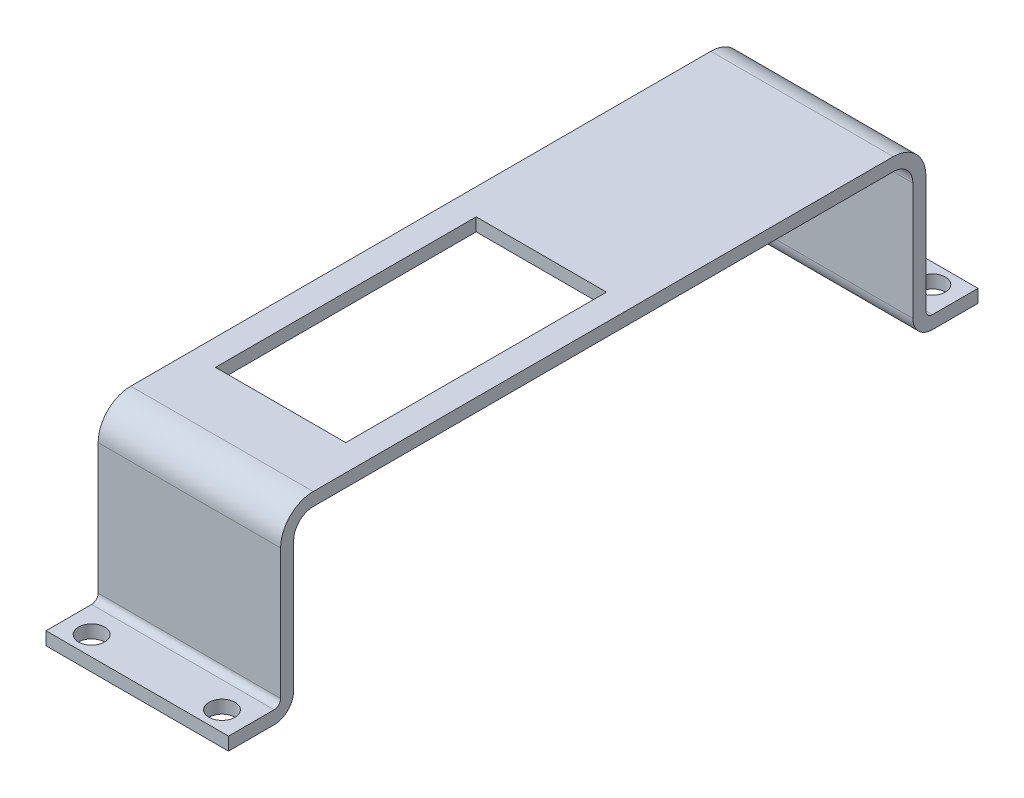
ISO-10303-21;
HEADER;
FILE_DESCRIPTION(('STEP AP214'),'2;1');
FILE_NAME('part.step','',(''),(''),'','','');
FILE_SCHEMA(('AUTOMOTIVE_DESIGN { 1 0 10303 214 1 1 1 1 }'));
ENDSEC;
DATA;
#1=APPLICATION_CONTEXT('core data for automotive mechanical design processes');
#2=APPLICATION_PROTOCOL_DEFINITION('international standard','automotive_design',2000,#1);
#3=PRODUCT_CONTEXT('',#1,'mechanical');
#4=PRODUCT('Part','Part','',(#3));
#5=PRODUCT_RELATED_PRODUCT_CATEGORY('part','',(#4));
#6=PRODUCT_DEFINITION_FORMATION('','',#4);
#7=PRODUCT_DEFINITION_CONTEXT('part definition',#1,'design');
#8=PRODUCT_DEFINITION('design','',#6,#7);
#9=PRODUCT_DEFINITION_SHAPE('','',#8);
#10=(LENGTH_UNIT() NAMED_UNIT(*) SI_UNIT(.MILLI.,.METRE.));
#11=(NAMED_UNIT(*) PLANE_ANGLE_UNIT() SI_UNIT($,.RADIAN.));
#12=(NAMED_UNIT(*) SI_UNIT($,.STERADIAN.) SOLID_ANGLE_UNIT());
#13=UNCERTAINTY_MEASURE_WITH_UNIT(LENGTH_MEASURE(1.E-05),#10,'distance_accuracy_value','');
#14=(GEOMETRIC_REPRESENTATION_CONTEXT(3) GLOBAL_UNCERTAINTY_ASSIGNED_CONTEXT((#13)) GLOBAL_UNIT_ASSIGNED_CONTEXT((#10,
#11,#12)) REPRESENTATION_CONTEXT('',''));
#15=CARTESIAN_POINT('',(0.,0.,0.));
#16=DIRECTION('',(0.,0.,1.));
#17=DIRECTION('',(1.,0.,0.));
#18=AXIS2_PLACEMENT_3D('',#15,#16,#17);
#19=CARTESIAN_POINT('',(14.,2.,-10.));
#20=DIRECTION('',(0.,0.,1.));
#21=DIRECTION('',(1.,0.,0.));
#22=AXIS2_PLACEMENT_3D('',#19,#20,#21);
#23=PLANE('',#22);
#24=DIRECTION('',(0.,1.,0.));
#25=VECTOR('',#24,1.);
#26=CARTESIAN_POINT('',(-14.,2.,-10.));
#27=LINE('',#26,#25);
#28=CARTESIAN_POINT('',(-14.,0.,-10.));
#29=VERTEX_POINT('',#28);
#30=CARTESIAN_POINT('',(-14.,2.,-10.));
#31=VERTEX_POINT('',#30);
#32=EDGE_CURVE('E221',#29,#31,#27,.T.);
#33=ORIENTED_EDGE('',*,*,#32,.T.);
#34=DIRECTION('',(-1.,0.,0.));
#35=VECTOR('',#34,1.);
#36=CARTESIAN_POINT('',(14.,2.,-10.));
#37=LINE('',#36,#35);
#38=CARTESIAN_POINT('',(14.,2.,-10.));
#39=VERTEX_POINT('',#38);
#40=EDGE_CURVE('E362',#39,#31,#37,.T.);
#41=ORIENTED_EDGE('',*,*,#40,.F.);
#42=DIRECTION('',(0.,1.,0.));
#43=VECTOR('',#42,1.);
#44=CARTESIAN_POINT('',(14.,2.,-10.));
#45=LINE('',#44,#43);
#46=CARTESIAN_POINT('',(14.,0.,-10.));
#47=VERTEX_POINT('',#46);
#48=EDGE_CURVE('E224',#47,#39,#45,.T.);
#49=ORIENTED_EDGE('',*,*,#48,.F.);
#50=DIRECTION('',(-1.,0.,0.));
#51=VECTOR('',#50,1.);
#52=CARTESIAN_POINT('',(14.,0.,-10.));
#53=LINE('',#52,#51);
#54=EDGE_CURVE('E266',#47,#29,#53,.T.);
#55=ORIENTED_EDGE('',*,*,#54,.T.);
#56=EDGE_LOOP('',(#33,#41,#49,#55));
#57=FACE_BOUND('',#56,.T.);
#58=ADVANCED_FACE('F33',(#57),#23,.F.);
#59=CARTESIAN_POINT('',(14.,2.,-3.));
#60=DIRECTION('',(0.,-1.,0.));
#61=DIRECTION('',(0.,0.,-1.));
#62=AXIS2_PLACEMENT_3D('',#59,#60,#61);
#63=PLANE('',#62);
#64=CARTESIAN_POINT('',(-10.,2.,-7.));
#65=DIRECTION('',(0.,1.,0.));
#66=DIRECTION('',(0.,0.,1.));
#67=AXIS2_PLACEMENT_3D('',#64,#65,#66);
#68=CIRCLE('',#67,2.);
#69=CARTESIAN_POINT('',(-10.,2.,-5.));
#70=VERTEX_POINT('',#69);
#71=EDGE_CURVE('E383',#70,#70,#68,.T.);
#72=ORIENTED_EDGE('',*,*,#71,.F.);
#73=EDGE_LOOP('',(#72));
#74=FACE_BOUND('',#73,.T.);
#75=CARTESIAN_POINT('',(10.,2.,-7.));
#76=DIRECTION('',(0.,1.,0.));
#77=DIRECTION('',(0.,0.,1.));
#78=AXIS2_PLACEMENT_3D('',#75,#76,#77);
#79=CIRCLE('',#78,2.);
#80=CARTESIAN_POINT('',(10.,2.,-5.));
#81=VERTEX_POINT('',#80);
#82=EDGE_CURVE('E372',#81,#81,#79,.T.);
#83=ORIENTED_EDGE('',*,*,#82,.F.);
#84=EDGE_LOOP('',(#83));
#85=FACE_BOUND('',#84,.T.);
#86=DIRECTION('',(0.,0.,1.));
#87=VECTOR('',#86,1.);
#88=CARTESIAN_POINT('',(-14.,2.,-3.));
#89=LINE('',#88,#87);
#90=CARTESIAN_POINT('',(-14.,2.,-3.));
#91=VERTEX_POINT('',#90);
#92=EDGE_CURVE('E269',#31,#91,#89,.T.);
#93=ORIENTED_EDGE('',*,*,#92,.T.);
#94=DIRECTION('',(-1.,0.,0.));
#95=VECTOR('',#94,1.);
#96=CARTESIAN_POINT('',(14.,2.,-3.));
#97=LINE('',#96,#95);
#98=CARTESIAN_POINT('',(14.,2.,-3.));
#99=VERTEX_POINT('',#98);
#100=EDGE_CURVE('E359',#99,#91,#97,.T.);
#101=ORIENTED_EDGE('',*,*,#100,.F.);
#102=DIRECTION('',(0.,0.,1.));
#103=VECTOR('',#102,1.);
#104=CARTESIAN_POINT('',(14.,2.,-3.));
#105=LINE('',#104,#103);
#106=EDGE_CURVE('E227',#39,#99,#105,.T.);
#107=ORIENTED_EDGE('',*,*,#106,.F.);
#108=ORIENTED_EDGE('',*,*,#40,.T.);
#109=EDGE_LOOP('',(#93,#101,#107,#108));
#110=FACE_BOUND('',#109,.T.);
#111=ADVANCED_FACE('F465',(#74,#85,#110),#63,.F.);
#112=CARTESIAN_POINT('',(14.,3.,-3.));
#113=DIRECTION('',(-1.,0.,0.));
#114=DIRECTION('',(0.,0.,1.));
#115=AXIS2_PLACEMENT_3D('',#112,#113,#114);
#116=CYLINDRICAL_SURFACE('',#115,1.);
#117=CARTESIAN_POINT('',(-14.,3.,-3.));
#118=DIRECTION('',(-1.,0.,0.));
#119=DIRECTION('',(0.,0.,-1.));
#120=AXIS2_PLACEMENT_3D('',#117,#118,#119);
#121=CIRCLE('',#120,1.);
#122=CARTESIAN_POINT('',(-14.,3.,-2.));
#123=VERTEX_POINT('',#122);
#124=EDGE_CURVE('E271',#91,#123,#121,.T.);
#125=ORIENTED_EDGE('',*,*,#124,.T.);
#126=DIRECTION('',(-1.,0.,0.));
#127=VECTOR('',#126,1.);
#128=CARTESIAN_POINT('',(14.,3.,-2.));
#129=LINE('',#128,#127);
#130=CARTESIAN_POINT('',(14.,3.,-2.));
#131=VERTEX_POINT('',#130);
#132=EDGE_CURVE('E356',#131,#123,#129,.T.);
#133=ORIENTED_EDGE('',*,*,#132,.F.);
#134=CARTESIAN_POINT('',(14.,3.,-3.));
#135=DIRECTION('',(-1.,0.,0.));
#136=DIRECTION('',(0.,0.,-1.));
#137=AXIS2_PLACEMENT_3D('',#134,#135,#136);
#138=CIRCLE('',#137,1.);
#139=EDGE_CURVE('E230',#99,#131,#138,.T.);
#140=ORIENTED_EDGE('',*,*,#139,.F.);
#141=ORIENTED_EDGE('',*,*,#100,.T.);
#142=EDGE_LOOP('',(#125,#133,#140,#141));
#143=FACE_BOUND('',#142,.T.);
#144=ADVANCED_FACE('F460',(#143),#116,.F.);
#145=CARTESIAN_POINT('',(14.,21.,-2.));
#146=DIRECTION('',(0.,0.,1.));
#147=DIRECTION('',(0.,-1.,0.));
#148=AXIS2_PLACEMENT_3D('',#145,#146,#147);
#149=PLANE('',#148);
#150=DIRECTION('',(0.,1.,0.));
#151=VECTOR('',#150,1.);
#152=CARTESIAN_POINT('',(-14.,21.,-2.));
#153=LINE('',#152,#151);
#154=CARTESIAN_POINT('',(-14.,21.,-2.));
#155=VERTEX_POINT('',#154);
#156=EDGE_CURVE('E273',#123,#155,#153,.T.);
#157=ORIENTED_EDGE('',*,*,#156,.T.);
#158=DIRECTION('',(-1.,0.,0.));
#159=VECTOR('',#158,1.);
#160=CARTESIAN_POINT('',(14.,21.,-2.));
#161=LINE('',#160,#159);
#162=CARTESIAN_POINT('',(14.,21.,-2.));
#163=VERTEX_POINT('',#162);
#164=EDGE_CURVE('E353',#163,#155,#161,.T.);
#165=ORIENTED_EDGE('',*,*,#164,.F.);
#166=DIRECTION('',(0.,1.,0.));
#167=VECTOR('',#166,1.);
#168=CARTESIAN_POINT('',(14.,21.,-2.));
#169=LINE('',#168,#167);
#170=EDGE_CURVE('E232',#131,#163,#169,.T.);
#171=ORIENTED_EDGE('',*,*,#170,.F.);
#172=ORIENTED_EDGE('',*,*,#132,.T.);
#173=EDGE_LOOP('',(#157,#165,#171,#172));
#174=FACE_BOUND('',#173,.T.);
#175=ADVANCED_FACE('F456',(#174),#149,.F.);
#176=CARTESIAN_POINT('',(14.,21.,3.));
#177=DIRECTION('',(-1.,0.,0.));
#178=DIRECTION('',(0.,0.,1.));
#179=AXIS2_PLACEMENT_3D('',#176,#177,#178);
#180=CYLINDRICAL_SURFACE('',#179,5.);
#181=CARTESIAN_POINT('',(-14.,21.,3.));
#182=DIRECTION('',(1.,0.,0.));
#183=DIRECTION('',(0.,0.,1.));
#184=AXIS2_PLACEMENT_3D('',#181,#182,#183);
#185=CIRCLE('',#184,5.);
#186=CARTESIAN_POINT('',(-14.,26.,3.));
#187=VERTEX_POINT('',#186);
#188=EDGE_CURVE('E275',#155,#187,#185,.T.);
#189=ORIENTED_EDGE('',*,*,#188,.T.);
#190=DIRECTION('',(-1.,0.,0.));
#191=VECTOR('',#190,1.);
#192=CARTESIAN_POINT('',(14.,26.,3.));
#193=LINE('',#192,#191);
#194=CARTESIAN_POINT('',(14.,26.,3.));
#195=VERTEX_POINT('',#194);
#196=EDGE_CURVE('E350',#195,#187,#193,.T.);
#197=ORIENTED_EDGE('',*,*,#196,.F.);
#198=CARTESIAN_POINT('',(14.,21.,3.));
#199=DIRECTION('',(1.,0.,0.));
#200=DIRECTION('',(0.,0.,1.));
#201=AXIS2_PLACEMENT_3D('',#198,#199,#200);
#202=CIRCLE('',#201,5.);
#203=EDGE_CURVE('E234',#163,#195,#202,.T.);
#204=ORIENTED_EDGE('',*,*,#203,.F.);
#205=ORIENTED_EDGE('',*,*,#164,.T.);
#206=EDGE_LOOP('',(#189,#197,#204,#205));
#207=FACE_BOUND('',#206,.T.);
#208=ADVANCED_FACE('F451',(#207),#180,.T.);
#209=CARTESIAN_POINT('',(14.,26.,3.));
#210=DIRECTION('',(0.,-1.,0.));
#211=DIRECTION('',(0.,0.,-1.));
#212=AXIS2_PLACEMENT_3D('',#209,#210,#211);
#213=PLANE('',#212);
#214=DIRECTION('',(1.,0.,0.));
#215=VECTOR('',#214,1.);
#216=CARTESIAN_POINT('',(-9.99999999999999,26.,83.));
#217=LINE('',#216,#215);
#218=CARTESIAN_POINT('',(-9.99999999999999,26.,83.));
#219=VERTEX_POINT('',#218);
#220=CARTESIAN_POINT('',(10.,26.,83.));
#221=VERTEX_POINT('',#220);
#222=EDGE_CURVE('E207',#219,#221,#217,.T.);
#223=ORIENTED_EDGE('',*,*,#222,.F.);
#224=DIRECTION('',(0.,0.,1.));
#225=VECTOR('',#224,1.);
#226=CARTESIAN_POINT('',(-9.99999999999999,26.,43.));
#227=LINE('',#226,#225);
#228=CARTESIAN_POINT('',(-9.99999999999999,26.,43.));
#229=VERTEX_POINT('',#228);
#230=EDGE_CURVE('E49',#229,#219,#227,.T.);
#231=ORIENTED_EDGE('',*,*,#230,.F.);
#232=DIRECTION('',(-1.,0.,0.));
#233=VECTOR('',#232,1.);
#234=CARTESIAN_POINT('',(-9.99999999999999,26.,43.));
#235=LINE('',#234,#233);
#236=CARTESIAN_POINT('',(10.,26.,43.));
#237=VERTEX_POINT('',#236);
#238=EDGE_CURVE('E214',#237,#229,#235,.T.);
#239=ORIENTED_EDGE('',*,*,#238,.F.);
#240=DIRECTION('',(0.,0.,-1.));
#241=VECTOR('',#240,1.);
#242=CARTESIAN_POINT('',(10.,26.,43.));
#243=LINE('',#242,#241);
#244=EDGE_CURVE('E198',#221,#237,#243,.T.);
#245=ORIENTED_EDGE('',*,*,#244,.F.);
#246=EDGE_LOOP('',(#223,#231,#239,#245));
#247=FACE_BOUND('',#246,.T.);
#248=DIRECTION('',(0.,0.,1.));
#249=VECTOR('',#248,1.);
#250=CARTESIAN_POINT('',(-14.,26.,3.));
#251=LINE('',#250,#249);
#252=CARTESIAN_POINT('',(-14.,26.,92.));
#253=VERTEX_POINT('',#252);
#254=EDGE_CURVE('E277',#187,#253,#251,.T.);
#255=ORIENTED_EDGE('',*,*,#254,.T.);
#256=DIRECTION('',(-1.,0.,0.));
#257=VECTOR('',#256,1.);
#258=CARTESIAN_POINT('',(14.,26.,92.));
#259=LINE('',#258,#257);
#260=CARTESIAN_POINT('',(14.,26.,92.));
#261=VERTEX_POINT('',#260);
#262=EDGE_CURVE('E347',#261,#253,#259,.T.);
#263=ORIENTED_EDGE('',*,*,#262,.F.);
#264=DIRECTION('',(0.,0.,1.));
#265=VECTOR('',#264,1.);
#266=CARTESIAN_POINT('',(14.,26.,3.));
#267=LINE('',#266,#265);
#268=EDGE_CURVE('E236',#195,#261,#267,.T.);
#269=ORIENTED_EDGE('',*,*,#268,.F.);
#270=ORIENTED_EDGE('',*,*,#196,.T.);
#271=EDGE_LOOP('',(#255,#263,#269,#270));
#272=FACE_BOUND('',#271,.T.);
#273=ADVANCED_FACE('F211',(#247,#272),#213,.F.);
#274=CARTESIAN_POINT('',(14.,21.,92.));
#275=DIRECTION('',(-1.,0.,0.));
#276=DIRECTION('',(0.,0.,1.));
#277=AXIS2_PLACEMENT_3D('',#274,#275,#276);
#278=CYLINDRICAL_SURFACE('',#277,5.);
#279=CARTESIAN_POINT('',(-14.,21.,92.));
#280=DIRECTION('',(1.,0.,0.));
#281=DIRECTION('',(0.,0.,-1.));
#282=AXIS2_PLACEMENT_3D('',#279,#280,#281);
#283=CIRCLE('',#282,5.);
#284=CARTESIAN_POINT('',(-14.,21.,97.));
#285=VERTEX_POINT('',#284);
#286=EDGE_CURVE('E279',#253,#285,#283,.T.);
#287=ORIENTED_EDGE('',*,*,#286,.T.);
#288=DIRECTION('',(-1.,0.,0.));
#289=VECTOR('',#288,1.);
#290=CARTESIAN_POINT('',(14.,21.,97.));
#291=LINE('',#290,#289);
#292=CARTESIAN_POINT('',(14.,21.,97.));
#293=VERTEX_POINT('',#292);
#294=EDGE_CURVE('E344',#293,#285,#291,.T.);
#295=ORIENTED_EDGE('',*,*,#294,.F.);
#296=CARTESIAN_POINT('',(14.,21.,92.));
#297=DIRECTION('',(1.,0.,0.));
#298=DIRECTION('',(0.,0.,-1.));
#299=AXIS2_PLACEMENT_3D('',#296,#297,#298);
#300=CIRCLE('',#299,5.);
#301=EDGE_CURVE('E238',#261,#293,#300,.T.);
#302=ORIENTED_EDGE('',*,*,#301,.F.);
#303=ORIENTED_EDGE('',*,*,#262,.T.);
#304=EDGE_LOOP('',(#287,#295,#302,#303));
#305=FACE_BOUND('',#304,.T.);
#306=ADVANCED_FACE('F443',(#305),#278,.T.);
#307=CARTESIAN_POINT('',(14.,21.,97.));
#308=DIRECTION('',(0.,0.,-1.));
#309=DIRECTION('',(-1.,0.,0.));
#310=AXIS2_PLACEMENT_3D('',#307,#308,#309);
#311=PLANE('',#310);
#312=DIRECTION('',(0.,-1.,0.));
#313=VECTOR('',#312,1.);
#314=CARTESIAN_POINT('',(-14.,21.,97.));
#315=LINE('',#314,#313);
#316=CARTESIAN_POINT('',(-14.,0.999999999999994,97.));
#317=VERTEX_POINT('',#316);
#318=EDGE_CURVE('E281',#285,#317,#315,.T.);
#319=ORIENTED_EDGE('',*,*,#318,.T.);
#320=DIRECTION('',(-1.,0.,0.));
#321=VECTOR('',#320,1.);
#322=CARTESIAN_POINT('',(14.,0.999999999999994,97.));
#323=LINE('',#322,#321);
#324=CARTESIAN_POINT('',(14.,0.999999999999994,97.));
#325=VERTEX_POINT('',#324);
#326=EDGE_CURVE('E341',#325,#317,#323,.T.);
#327=ORIENTED_EDGE('',*,*,#326,.F.);
#328=DIRECTION('',(0.,-1.,0.));
#329=VECTOR('',#328,1.);
#330=CARTESIAN_POINT('',(14.,21.,97.));
#331=LINE('',#330,#329);
#332=EDGE_CURVE('E240',#293,#325,#331,.T.);
#333=ORIENTED_EDGE('',*,*,#332,.F.);
#334=ORIENTED_EDGE('',*,*,#294,.T.);
#335=EDGE_LOOP('',(#319,#327,#333,#334));
#336=FACE_BOUND('',#335,.T.);
#337=ADVANCED_FACE('F439',(#336),#311,.F.);
#338=CARTESIAN_POINT('',(14.,0.999999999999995,98.));
#339=DIRECTION('',(-1.,0.,0.));
#340=DIRECTION('',(0.,0.,1.));
#341=AXIS2_PLACEMENT_3D('',#338,#339,#340);
#342=CYLINDRICAL_SURFACE('',#341,1.);
#343=CARTESIAN_POINT('',(-14.,0.999999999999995,98.));
#344=DIRECTION('',(-1.,0.,0.));
#345=DIRECTION('',(0.,0.,1.));
#346=AXIS2_PLACEMENT_3D('',#343,#344,#345);
#347=CIRCLE('',#346,1.);
#348=CARTESIAN_POINT('',(-14.,0.,98.));
#349=VERTEX_POINT('',#348);
#350=EDGE_CURVE('E283',#317,#349,#347,.T.);
#351=ORIENTED_EDGE('',*,*,#350,.T.);
#352=DIRECTION('',(-1.,0.,0.));
#353=VECTOR('',#352,1.);
#354=CARTESIAN_POINT('',(14.,0.,98.));
#355=LINE('',#354,#353);
#356=CARTESIAN_POINT('',(14.,0.,98.));
#357=VERTEX_POINT('',#356);
#358=EDGE_CURVE('E338',#357,#349,#355,.T.);
#359=ORIENTED_EDGE('',*,*,#358,.F.);
#360=CARTESIAN_POINT('',(14.,0.999999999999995,98.));
#361=DIRECTION('',(-1.,0.,0.));
#362=DIRECTION('',(0.,0.,1.));
#363=AXIS2_PLACEMENT_3D('',#360,#361,#362);
#364=CIRCLE('',#363,1.);
#365=EDGE_CURVE('E242',#325,#357,#364,.T.);
#366=ORIENTED_EDGE('',*,*,#365,.F.);
#367=ORIENTED_EDGE('',*,*,#326,.T.);
#368=EDGE_LOOP('',(#351,#359,#366,#367));
#369=FACE_BOUND('',#368,.T.);
#370=ADVANCED_FACE('F401',(#369),#342,.F.);
#371=CARTESIAN_POINT('',(14.,0.,98.));
#372=DIRECTION('',(0.,-1.,0.));
#373=DIRECTION('',(0.,0.,-1.));
#374=AXIS2_PLACEMENT_3D('',#371,#372,#373);
#375=PLANE('',#374);
#376=CARTESIAN_POINT('',(-10.,0.,102.));
#377=DIRECTION('',(0.,1.,0.));
#378=DIRECTION('',(0.,0.,1.));
#379=AXIS2_PLACEMENT_3D('',#376,#377,#378);
#380=CIRCLE('',#379,2.);
#381=CARTESIAN_POINT('',(-10.,0.,104.));
#382=VERTEX_POINT('',#381);
#383=EDGE_CURVE('E371',#382,#382,#380,.T.);
#384=ORIENTED_EDGE('',*,*,#383,.F.);
#385=EDGE_LOOP('',(#384));
#386=FACE_BOUND('',#385,.T.);
#387=CARTESIAN_POINT('',(10.,0.,102.));
#388=DIRECTION('',(0.,1.,0.));
#389=DIRECTION('',(0.,0.,1.));
#390=AXIS2_PLACEMENT_3D('',#387,#388,#389);
#391=CIRCLE('',#390,2.);
#392=CARTESIAN_POINT('',(10.,0.,104.));
#393=VERTEX_POINT('',#392);
#394=EDGE_CURVE('E387',#393,#393,#391,.T.);
#395=ORIENTED_EDGE('',*,*,#394,.F.);
#396=EDGE_LOOP('',(#395));
#397=FACE_BOUND('',#396,.T.);
#398=DIRECTION('',(0.,0.,1.));
#399=VECTOR('',#398,1.);
#400=CARTESIAN_POINT('',(-14.,0.,98.));
#401=LINE('',#400,#399);
#402=CARTESIAN_POINT('',(-14.,0.,105.));
#403=VERTEX_POINT('',#402);
#404=EDGE_CURVE('E285',#349,#403,#401,.T.);
#405=ORIENTED_EDGE('',*,*,#404,.T.);
#406=DIRECTION('',(-1.,0.,0.));
#407=VECTOR('',#406,1.);
#408=CARTESIAN_POINT('',(14.,0.,105.));
#409=LINE('',#408,#407);
#410=CARTESIAN_POINT('',(14.,0.,105.));
#411=VERTEX_POINT('',#410);
#412=EDGE_CURVE('E335',#411,#403,#409,.T.);
#413=ORIENTED_EDGE('',*,*,#412,.F.);
#414=DIRECTION('',(0.,0.,1.));
#415=VECTOR('',#414,1.);
#416=CARTESIAN_POINT('',(14.,0.,98.));
#417=LINE('',#416,#415);
#418=EDGE_CURVE('E244',#357,#411,#417,.T.);
#419=ORIENTED_EDGE('',*,*,#418,.F.);
#420=ORIENTED_EDGE('',*,*,#358,.T.);
#421=EDGE_LOOP('',(#405,#413,#419,#420));
#422=FACE_BOUND('',#421,.T.);
#423=ADVANCED_FACE('F397',(#386,#397,#422),#375,.F.);
#424=CARTESIAN_POINT('',(14.,0.,105.));
#425=DIRECTION('',(0.,0.,-1.));
#426=DIRECTION('',(-1.,0.,0.));
#427=AXIS2_PLACEMENT_3D('',#424,#425,#426);
#428=PLANE('',#427);
#429=DIRECTION('',(0.,-1.,0.));
#430=VECTOR('',#429,1.);
#431=CARTESIAN_POINT('',(-14.,0.,105.));
#432=LINE('',#431,#430);
#433=CARTESIAN_POINT('',(-14.,-2.00000000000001,105.));
#434=VERTEX_POINT('',#433);
#435=EDGE_CURVE('E287',#403,#434,#432,.T.);
#436=ORIENTED_EDGE('',*,*,#435,.T.);
#437=DIRECTION('',(-1.,0.,0.));
#438=VECTOR('',#437,1.);
#439=CARTESIAN_POINT('',(14.,-2.00000000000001,105.));
#440=LINE('',#439,#438);
#441=CARTESIAN_POINT('',(14.,-2.00000000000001,105.));
#442=VERTEX_POINT('',#441);
#443=EDGE_CURVE('E332',#442,#434,#440,.T.);
#444=ORIENTED_EDGE('',*,*,#443,.F.);
#445=DIRECTION('',(0.,-1.,0.));
#446=VECTOR('',#445,1.);
#447=CARTESIAN_POINT('',(14.,0.,105.));
#448=LINE('',#447,#446);
#449=EDGE_CURVE('E246',#411,#442,#448,.T.);
#450=ORIENTED_EDGE('',*,*,#449,.F.);
#451=ORIENTED_EDGE('',*,*,#412,.T.);
#452=EDGE_LOOP('',(#436,#444,#450,#451));
#453=FACE_BOUND('',#452,.T.);
#454=ADVANCED_FACE('F400',(#453),#428,.F.);
#455=CARTESIAN_POINT('',(14.,-2.00000000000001,98.));
#456=DIRECTION('',(0.,1.,0.));
#457=DIRECTION('',(0.,0.,1.));
#458=AXIS2_PLACEMENT_3D('',#455,#456,#457);
#459=PLANE('',#458);
#460=CARTESIAN_POINT('',(-10.,-2.00000000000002,102.));
#461=DIRECTION('',(0.,1.,0.));
#462=DIRECTION('',(0.,0.,1.));
#463=AXIS2_PLACEMENT_3D('',#460,#461,#462);
#464=CIRCLE('',#463,2.);
#465=CARTESIAN_POINT('',(-10.,-2.00000000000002,104.));
#466=VERTEX_POINT('',#465);
#467=EDGE_CURVE('E376',#466,#466,#464,.T.);
#468=ORIENTED_EDGE('',*,*,#467,.T.);
#469=EDGE_LOOP('',(#468));
#470=FACE_BOUND('',#469,.T.);
#471=CARTESIAN_POINT('',(10.,-2.00000000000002,102.));
#472=DIRECTION('',(0.,1.,0.));
#473=DIRECTION('',(0.,0.,1.));
#474=AXIS2_PLACEMENT_3D('',#471,#472,#473);
#475=CIRCLE('',#474,2.);
#476=CARTESIAN_POINT('',(10.,-2.00000000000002,104.));
#477=VERTEX_POINT('',#476);
#478=EDGE_CURVE('E389',#477,#477,#475,.T.);
#479=ORIENTED_EDGE('',*,*,#478,.T.);
#480=EDGE_LOOP('',(#479));
#481=FACE_BOUND('',#480,.T.);
#482=DIRECTION('',(0.,0.,-1.));
#483=VECTOR('',#482,1.);
#484=CARTESIAN_POINT('',(-14.,-2.00000000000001,98.));
#485=LINE('',#484,#483);
#486=CARTESIAN_POINT('',(-14.,-2.00000000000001,98.));
#487=VERTEX_POINT('',#486);
#488=EDGE_CURVE('E289',#434,#487,#485,.T.);
#489=ORIENTED_EDGE('',*,*,#488,.T.);
#490=DIRECTION('',(-1.,0.,0.));
#491=VECTOR('',#490,1.);
#492=CARTESIAN_POINT('',(14.,-2.00000000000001,98.));
#493=LINE('',#492,#491);
#494=CARTESIAN_POINT('',(14.,-2.00000000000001,98.));
#495=VERTEX_POINT('',#494);
#496=EDGE_CURVE('E329',#495,#487,#493,.T.);
#497=ORIENTED_EDGE('',*,*,#496,.F.);
#498=DIRECTION('',(0.,0.,-1.));
#499=VECTOR('',#498,1.);
#500=CARTESIAN_POINT('',(14.,-2.00000000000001,98.));
#501=LINE('',#500,#499);
#502=EDGE_CURVE('E248',#442,#495,#501,.T.);
#503=ORIENTED_EDGE('',*,*,#502,.F.);
#504=ORIENTED_EDGE('',*,*,#443,.T.);
#505=EDGE_LOOP('',(#489,#497,#503,#504));
#506=FACE_BOUND('',#505,.T.);
#507=ADVANCED_FACE('F421',(#470,#481,#506),#459,.F.);
#508=CARTESIAN_POINT('',(14.,0.999999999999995,98.));
#509=DIRECTION('',(-1.,0.,0.));
#510=DIRECTION('',(0.,0.,1.));
#511=AXIS2_PLACEMENT_3D('',#508,#509,#510);
#512=CYLINDRICAL_SURFACE('',#511,3.);
#513=CARTESIAN_POINT('',(-14.,0.999999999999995,98.));
#514=DIRECTION('',(1.,0.,0.));
#515=DIRECTION('',(0.,0.,1.));
#516=AXIS2_PLACEMENT_3D('',#513,#514,#515);
#517=CIRCLE('',#516,3.);
#518=CARTESIAN_POINT('',(-14.,0.999999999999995,95.));
#519=VERTEX_POINT('',#518);
#520=EDGE_CURVE('E291',#487,#519,#517,.T.);
#521=ORIENTED_EDGE('',*,*,#520,.T.);
#522=DIRECTION('',(-1.,0.,0.));
#523=VECTOR('',#522,1.);
#524=CARTESIAN_POINT('',(14.,0.999999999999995,95.));
#525=LINE('',#524,#523);
#526=CARTESIAN_POINT('',(14.,0.999999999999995,95.));
#527=VERTEX_POINT('',#526);
#528=EDGE_CURVE('E326',#527,#519,#525,.T.);
#529=ORIENTED_EDGE('',*,*,#528,.F.);
#530=CARTESIAN_POINT('',(14.,0.999999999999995,98.));
#531=DIRECTION('',(1.,0.,0.));
#532=DIRECTION('',(0.,0.,1.));
#533=AXIS2_PLACEMENT_3D('',#530,#531,#532);
#534=CIRCLE('',#533,3.);
#535=EDGE_CURVE('E250',#495,#527,#534,.T.);
#536=ORIENTED_EDGE('',*,*,#535,.F.);
#537=ORIENTED_EDGE('',*,*,#496,.T.);
#538=EDGE_LOOP('',(#521,#529,#536,#537));
#539=FACE_BOUND('',#538,.T.);
#540=ADVANCED_FACE('F425',(#539),#512,.T.);
#541=CARTESIAN_POINT('',(14.,21.,95.));
#542=DIRECTION('',(0.,0.,1.));
#543=DIRECTION('',(1.,0.,0.));
#544=AXIS2_PLACEMENT_3D('',#541,#542,#543);
#545=PLANE('',#544);
#546=DIRECTION('',(0.,1.,0.));
#547=VECTOR('',#546,1.);
#548=CARTESIAN_POINT('',(-14.,21.,95.));
#549=LINE('',#548,#547);
#550=CARTESIAN_POINT('',(-14.,21.,95.));
#551=VERTEX_POINT('',#550);
#552=EDGE_CURVE('E293',#519,#551,#549,.T.);
#553=ORIENTED_EDGE('',*,*,#552,.T.);
#554=DIRECTION('',(-1.,0.,0.));
#555=VECTOR('',#554,1.);
#556=CARTESIAN_POINT('',(14.,21.,95.));
#557=LINE('',#556,#555);
#558=CARTESIAN_POINT('',(14.,21.,95.));
#559=VERTEX_POINT('',#558);
#560=EDGE_CURVE('E323',#559,#551,#557,.T.);
#561=ORIENTED_EDGE('',*,*,#560,.F.);
#562=DIRECTION('',(0.,1.,0.));
#563=VECTOR('',#562,1.);
#564=CARTESIAN_POINT('',(14.,21.,95.));
#565=LINE('',#564,#563);
#566=EDGE_CURVE('E252',#527,#559,#565,.T.);
#567=ORIENTED_EDGE('',*,*,#566,.F.);
#568=ORIENTED_EDGE('',*,*,#528,.T.);
#569=EDGE_LOOP('',(#553,#561,#567,#568));
#570=FACE_BOUND('',#569,.T.);
#571=ADVANCED_FACE('F498',(#570),#545,.F.);
#572=CARTESIAN_POINT('',(14.,21.,92.));
#573=DIRECTION('',(-1.,0.,0.));
#574=DIRECTION('',(0.,0.,1.));
#575=AXIS2_PLACEMENT_3D('',#572,#573,#574);
#576=CYLINDRICAL_SURFACE('',#575,3.);
#577=CARTESIAN_POINT('',(-14.,21.,92.));
#578=DIRECTION('',(-1.,0.,0.));
#579=DIRECTION('',(0.,0.,-1.));
#580=AXIS2_PLACEMENT_3D('',#577,#578,#579);
#581=CIRCLE('',#580,3.);
#582=CARTESIAN_POINT('',(-14.,24.,92.));
#583=VERTEX_POINT('',#582);
#584=EDGE_CURVE('E295',#551,#583,#581,.T.);
#585=ORIENTED_EDGE('',*,*,#584,.T.);
#586=DIRECTION('',(-1.,0.,0.));
#587=VECTOR('',#586,1.);
#588=CARTESIAN_POINT('',(14.,24.,92.));
#589=LINE('',#588,#587);
#590=CARTESIAN_POINT('',(14.,24.,92.));
#591=VERTEX_POINT('',#590);
#592=EDGE_CURVE('E320',#591,#583,#589,.T.);
#593=ORIENTED_EDGE('',*,*,#592,.F.);
#594=CARTESIAN_POINT('',(14.,21.,92.));
#595=DIRECTION('',(-1.,0.,0.));
#596=DIRECTION('',(0.,0.,-1.));
#597=AXIS2_PLACEMENT_3D('',#594,#595,#596);
#598=CIRCLE('',#597,3.);
#599=EDGE_CURVE('E254',#559,#591,#598,.T.);
#600=ORIENTED_EDGE('',*,*,#599,.F.);
#601=ORIENTED_EDGE('',*,*,#560,.T.);
#602=EDGE_LOOP('',(#585,#593,#600,#601));
#603=FACE_BOUND('',#602,.T.);
#604=ADVANCED_FACE('F496',(#603),#576,.F.);
#605=CARTESIAN_POINT('',(14.,24.,3.));
#606=DIRECTION('',(0.,1.,0.));
#607=DIRECTION('',(0.,0.,1.));
#608=AXIS2_PLACEMENT_3D('',#605,#606,#607);
#609=PLANE('',#608);
#610=DIRECTION('',(-1.,0.,0.));
#611=VECTOR('',#610,1.);
#612=CARTESIAN_POINT('',(14.,24.,43.));
#613=LINE('',#612,#611);
#614=CARTESIAN_POINT('',(10.,24.,43.));
#615=VERTEX_POINT('',#614);
#616=CARTESIAN_POINT('',(-9.99999999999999,24.,43.));
#617=VERTEX_POINT('',#616);
#618=EDGE_CURVE('E41',#615,#617,#613,.T.);
#619=ORIENTED_EDGE('',*,*,#618,.T.);
#620=DIRECTION('',(0.,0.,1.));
#621=VECTOR('',#620,1.);
#622=CARTESIAN_POINT('',(-10.,24.,3.));
#623=LINE('',#622,#621);
#624=CARTESIAN_POINT('',(-9.99999999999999,24.,83.));
#625=VERTEX_POINT('',#624);
#626=EDGE_CURVE('E11',#617,#625,#623,.T.);
#627=ORIENTED_EDGE('',*,*,#626,.T.);
#628=DIRECTION('',(1.,0.,0.));
#629=VECTOR('',#628,1.);
#630=CARTESIAN_POINT('',(14.,24.,83.));
#631=LINE('',#630,#629);
#632=CARTESIAN_POINT('',(10.,24.,83.));
#633=VERTEX_POINT('',#632);
#634=EDGE_CURVE('E365',#625,#633,#631,.T.);
#635=ORIENTED_EDGE('',*,*,#634,.T.);
#636=DIRECTION('',(0.,0.,-1.));
#637=VECTOR('',#636,1.);
#638=CARTESIAN_POINT('',(10.,24.,3.));
#639=LINE('',#638,#637);
#640=EDGE_CURVE('E201',#633,#615,#639,.T.);
#641=ORIENTED_EDGE('',*,*,#640,.T.);
#642=EDGE_LOOP('',(#619,#627,#635,#641));
#643=FACE_BOUND('',#642,.T.);
#644=DIRECTION('',(0.,0.,-1.));
#645=VECTOR('',#644,1.);
#646=CARTESIAN_POINT('',(-14.,24.,3.));
#647=LINE('',#646,#645);
#648=CARTESIAN_POINT('',(-14.,24.,3.));
#649=VERTEX_POINT('',#648);
#650=EDGE_CURVE('E297',#583,#649,#647,.T.);
#651=ORIENTED_EDGE('',*,*,#650,.T.);
#652=DIRECTION('',(-1.,0.,0.));
#653=VECTOR('',#652,1.);
#654=CARTESIAN_POINT('',(14.,24.,3.));
#655=LINE('',#654,#653);
#656=CARTESIAN_POINT('',(14.,24.,3.));
#657=VERTEX_POINT('',#656);
#658=EDGE_CURVE('E317',#657,#649,#655,.T.);
#659=ORIENTED_EDGE('',*,*,#658,.F.);
#660=DIRECTION('',(0.,0.,-1.));
#661=VECTOR('',#660,1.);
#662=CARTESIAN_POINT('',(14.,24.,3.));
#663=LINE('',#662,#661);
#664=EDGE_CURVE('E256',#591,#657,#663,.T.);
#665=ORIENTED_EDGE('',*,*,#664,.F.);
#666=ORIENTED_EDGE('',*,*,#592,.T.);
#667=EDGE_LOOP('',(#651,#659,#665,#666));
#668=FACE_BOUND('',#667,.T.);
#669=ADVANCED_FACE('F491',(#643,#668),#609,.F.);
#670=CARTESIAN_POINT('',(14.,21.,3.));
#671=DIRECTION('',(-1.,0.,0.));
#672=DIRECTION('',(0.,0.,1.));
#673=AXIS2_PLACEMENT_3D('',#670,#671,#672);
#674=CYLINDRICAL_SURFACE('',#673,3.);
#675=CARTESIAN_POINT('',(-14.,21.,3.));
#676=DIRECTION('',(-1.,0.,0.));
#677=DIRECTION('',(0.,0.,1.));
#678=AXIS2_PLACEMENT_3D('',#675,#676,#677);
#679=CIRCLE('',#678,3.);
#680=CARTESIAN_POINT('',(-14.,21.,0.));
#681=VERTEX_POINT('',#680);
#682=EDGE_CURVE('E299',#649,#681,#679,.T.);
#683=ORIENTED_EDGE('',*,*,#682,.T.);
#684=DIRECTION('',(-1.,0.,0.));
#685=VECTOR('',#684,1.);
#686=CARTESIAN_POINT('',(14.,21.,0.));
#687=LINE('',#686,#685);
#688=CARTESIAN_POINT('',(14.,21.,0.));
#689=VERTEX_POINT('',#688);
#690=EDGE_CURVE('E314',#689,#681,#687,.T.);
#691=ORIENTED_EDGE('',*,*,#690,.F.);
#692=CARTESIAN_POINT('',(14.,21.,3.));
#693=DIRECTION('',(-1.,0.,0.));
#694=DIRECTION('',(0.,0.,1.));
#695=AXIS2_PLACEMENT_3D('',#692,#693,#694);
#696=CIRCLE('',#695,3.);
#697=EDGE_CURVE('E258',#657,#689,#696,.T.);
#698=ORIENTED_EDGE('',*,*,#697,.F.);
#699=ORIENTED_EDGE('',*,*,#658,.T.);
#700=EDGE_LOOP('',(#683,#691,#698,#699));
#701=FACE_BOUND('',#700,.T.);
#702=ADVANCED_FACE('F486',(#701),#674,.F.);
#703=CARTESIAN_POINT('',(14.,21.,0.));
#704=DIRECTION('',(0.,0.,-1.));
#705=DIRECTION('',(0.,1.,0.));
#706=AXIS2_PLACEMENT_3D('',#703,#704,#705);
#707=PLANE('',#706);
#708=DIRECTION('',(0.,-1.,0.));
#709=VECTOR('',#708,1.);
#710=CARTESIAN_POINT('',(-14.,21.,0.));
#711=LINE('',#710,#709);
#712=CARTESIAN_POINT('',(-14.,3.,0.));
#713=VERTEX_POINT('',#712);
#714=EDGE_CURVE('E301',#681,#713,#711,.T.);
#715=ORIENTED_EDGE('',*,*,#714,.T.);
#716=DIRECTION('',(-1.,0.,0.));
#717=VECTOR('',#716,1.);
#718=CARTESIAN_POINT('',(14.,3.,0.));
#719=LINE('',#718,#717);
#720=CARTESIAN_POINT('',(14.,3.,0.));
#721=VERTEX_POINT('',#720);
#722=EDGE_CURVE('E311',#721,#713,#719,.T.);
#723=ORIENTED_EDGE('',*,*,#722,.F.);
#724=DIRECTION('',(0.,-1.,0.));
#725=VECTOR('',#724,1.);
#726=CARTESIAN_POINT('',(14.,21.,0.));
#727=LINE('',#726,#725);
#728=EDGE_CURVE('E260',#689,#721,#727,.T.);
#729=ORIENTED_EDGE('',*,*,#728,.F.);
#730=ORIENTED_EDGE('',*,*,#690,.T.);
#731=EDGE_LOOP('',(#715,#723,#729,#730));
#732=FACE_BOUND('',#731,.T.);
#733=ADVANCED_FACE('F482',(#732),#707,.F.);
#734=CARTESIAN_POINT('',(14.,3.,-3.));
#735=DIRECTION('',(-1.,0.,0.));
#736=DIRECTION('',(0.,0.,1.));
#737=AXIS2_PLACEMENT_3D('',#734,#735,#736);
#738=CYLINDRICAL_SURFACE('',#737,3.);
#739=CARTESIAN_POINT('',(-14.,3.,-3.));
#740=DIRECTION('',(1.,0.,0.));
#741=DIRECTION('',(0.,0.,-1.));
#742=AXIS2_PLACEMENT_3D('',#739,#740,#741);
#743=CIRCLE('',#742,3.);
#744=CARTESIAN_POINT('',(-14.,0.,-3.));
#745=VERTEX_POINT('',#744);
#746=EDGE_CURVE('E303',#713,#745,#743,.T.);
#747=ORIENTED_EDGE('',*,*,#746,.T.);
#748=DIRECTION('',(-1.,0.,0.));
#749=VECTOR('',#748,1.);
#750=CARTESIAN_POINT('',(14.,0.,-3.));
#751=LINE('',#750,#749);
#752=CARTESIAN_POINT('',(14.,0.,-3.));
#753=VERTEX_POINT('',#752);
#754=EDGE_CURVE('E308',#753,#745,#751,.T.);
#755=ORIENTED_EDGE('',*,*,#754,.F.);
#756=CARTESIAN_POINT('',(14.,3.,-3.));
#757=DIRECTION('',(1.,0.,0.));
#758=DIRECTION('',(0.,0.,-1.));
#759=AXIS2_PLACEMENT_3D('',#756,#757,#758);
#760=CIRCLE('',#759,3.);
#761=EDGE_CURVE('E262',#721,#753,#760,.T.);
#762=ORIENTED_EDGE('',*,*,#761,.F.);
#763=ORIENTED_EDGE('',*,*,#722,.T.);
#764=EDGE_LOOP('',(#747,#755,#762,#763));
#765=FACE_BOUND('',#764,.T.);
#766=ADVANCED_FACE('F477',(#765),#738,.T.);
#767=CARTESIAN_POINT('',(14.,0.,-3.));
#768=DIRECTION('',(0.,1.,0.));
#769=DIRECTION('',(0.,0.,1.));
#770=AXIS2_PLACEMENT_3D('',#767,#768,#769);
#771=PLANE('',#770);
#772=CARTESIAN_POINT('',(-10.,0.,-7.));
#773=DIRECTION('',(0.,1.,0.));
#774=DIRECTION('',(0.,0.,1.));
#775=AXIS2_PLACEMENT_3D('',#772,#773,#774);
#776=CIRCLE('',#775,2.);
#777=CARTESIAN_POINT('',(-10.,0.,-5.));
#778=VERTEX_POINT('',#777);
#779=EDGE_CURVE('E36',#778,#778,#776,.T.);
#780=ORIENTED_EDGE('',*,*,#779,.T.);
#781=EDGE_LOOP('',(#780));
#782=FACE_BOUND('',#781,.T.);
#783=CARTESIAN_POINT('',(10.,0.,-7.));
#784=DIRECTION('',(0.,1.,0.));
#785=DIRECTION('',(0.,0.,1.));
#786=AXIS2_PLACEMENT_3D('',#783,#784,#785);
#787=CIRCLE('',#786,2.);
#788=CARTESIAN_POINT('',(10.,0.,-5.));
#789=VERTEX_POINT('',#788);
#790=EDGE_CURVE('E369',#789,#789,#787,.T.);
#791=ORIENTED_EDGE('',*,*,#790,.T.);
#792=EDGE_LOOP('',(#791));
#793=FACE_BOUND('',#792,.T.);
#794=DIRECTION('',(0.,0.,-1.));
#795=VECTOR('',#794,1.);
#796=CARTESIAN_POINT('',(-14.,0.,-3.));
#797=LINE('',#796,#795);
#798=EDGE_CURVE('E228',#745,#29,#797,.T.);
#799=ORIENTED_EDGE('',*,*,#798,.T.);
#800=ORIENTED_EDGE('',*,*,#54,.F.);
#801=DIRECTION('',(0.,0.,-1.));
#802=VECTOR('',#801,1.);
#803=CARTESIAN_POINT('',(14.,0.,-3.));
#804=LINE('',#803,#802);
#805=EDGE_CURVE('E264',#753,#47,#804,.T.);
#806=ORIENTED_EDGE('',*,*,#805,.F.);
#807=ORIENTED_EDGE('',*,*,#754,.T.);
#808=EDGE_LOOP('',(#799,#800,#806,#807));
#809=FACE_BOUND('',#808,.T.);
#810=ADVANCED_FACE('F471',(#782,#793,#809),#771,.F.);
#811=CARTESIAN_POINT('',(14.,3.,-3.));
#812=DIRECTION('',(1.,0.,0.));
#813=DIRECTION('',(0.,0.,-1.));
#814=AXIS2_PLACEMENT_3D('',#811,#812,#813);
#815=PLANE('',#814);
#816=ORIENTED_EDGE('',*,*,#48,.T.);
#817=ORIENTED_EDGE('',*,*,#106,.T.);
#818=ORIENTED_EDGE('',*,*,#139,.T.);
#819=ORIENTED_EDGE('',*,*,#170,.T.);
#820=ORIENTED_EDGE('',*,*,#203,.T.);
#821=ORIENTED_EDGE('',*,*,#268,.T.);
#822=ORIENTED_EDGE('',*,*,#301,.T.);
#823=ORIENTED_EDGE('',*,*,#332,.T.);
#824=ORIENTED_EDGE('',*,*,#365,.T.);
#825=ORIENTED_EDGE('',*,*,#418,.T.);
#826=ORIENTED_EDGE('',*,*,#449,.T.);
#827=ORIENTED_EDGE('',*,*,#502,.T.);
#828=ORIENTED_EDGE('',*,*,#535,.T.);
#829=ORIENTED_EDGE('',*,*,#566,.T.);
#830=ORIENTED_EDGE('',*,*,#599,.T.);
#831=ORIENTED_EDGE('',*,*,#664,.T.);
#832=ORIENTED_EDGE('',*,*,#697,.T.);
#833=ORIENTED_EDGE('',*,*,#728,.T.);
#834=ORIENTED_EDGE('',*,*,#761,.T.);
#835=ORIENTED_EDGE('',*,*,#805,.T.);
#836=EDGE_LOOP('',(#816,#817,#818,#819,#820,#821,#822,#823,#824,#825,#826,#827,#828,#829,#830,
#831,#832,#833,#834,#835));
#837=FACE_BOUND('',#836,.T.);
#838=ADVANCED_FACE('F429',(#837),#815,.T.);
#839=CARTESIAN_POINT('',(-14.,3.,-3.));
#840=DIRECTION('',(1.,0.,0.));
#841=DIRECTION('',(0.,0.,-1.));
#842=AXIS2_PLACEMENT_3D('',#839,#840,#841);
#843=PLANE('',#842);
#844=ORIENTED_EDGE('',*,*,#32,.F.);
#845=ORIENTED_EDGE('',*,*,#798,.F.);
#846=ORIENTED_EDGE('',*,*,#746,.F.);
#847=ORIENTED_EDGE('',*,*,#714,.F.);
#848=ORIENTED_EDGE('',*,*,#682,.F.);
#849=ORIENTED_EDGE('',*,*,#650,.F.);
#850=ORIENTED_EDGE('',*,*,#584,.F.);
#851=ORIENTED_EDGE('',*,*,#552,.F.);
#852=ORIENTED_EDGE('',*,*,#520,.F.);
#853=ORIENTED_EDGE('',*,*,#488,.F.);
#854=ORIENTED_EDGE('',*,*,#435,.F.);
#855=ORIENTED_EDGE('',*,*,#404,.F.);
#856=ORIENTED_EDGE('',*,*,#350,.F.);
#857=ORIENTED_EDGE('',*,*,#318,.F.);
#858=ORIENTED_EDGE('',*,*,#286,.F.);
#859=ORIENTED_EDGE('',*,*,#254,.F.);
#860=ORIENTED_EDGE('',*,*,#188,.F.);
#861=ORIENTED_EDGE('',*,*,#156,.F.);
#862=ORIENTED_EDGE('',*,*,#124,.F.);
#863=ORIENTED_EDGE('',*,*,#92,.F.);
#864=EDGE_LOOP('',(#844,#845,#846,#847,#848,#849,#850,#851,#852,#853,#854,#855,#856,#857,#858,
#859,#860,#861,#862,#863));
#865=FACE_BOUND('',#864,.T.);
#866=ADVANCED_FACE('F416',(#865),#843,.F.);
#867=CARTESIAN_POINT('',(-9.99999999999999,-2.00000000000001,43.));
#868=DIRECTION('',(-1.,0.,0.));
#869=DIRECTION('',(0.,0.,1.));
#870=AXIS2_PLACEMENT_3D('',#867,#868,#869);
#871=PLANE('',#870);
#872=DIRECTION('',(0.,1.,0.));
#873=VECTOR('',#872,1.);
#874=CARTESIAN_POINT('',(-9.99999999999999,-2.00000000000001,43.));
#875=LINE('',#874,#873);
#876=EDGE_CURVE('E219',#617,#229,#875,.T.);
#877=ORIENTED_EDGE('',*,*,#876,.T.);
#878=ORIENTED_EDGE('',*,*,#230,.T.);
#879=DIRECTION('',(0.,1.,0.));
#880=VECTOR('',#879,1.);
#881=CARTESIAN_POINT('',(-9.99999999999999,-2.00000000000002,83.));
#882=LINE('',#881,#880);
#883=EDGE_CURVE('E204',#625,#219,#882,.T.);
#884=ORIENTED_EDGE('',*,*,#883,.F.);
#885=ORIENTED_EDGE('',*,*,#626,.F.);
#886=EDGE_LOOP('',(#877,#878,#884,#885));
#887=FACE_BOUND('',#886,.T.);
#888=ADVANCED_FACE('F559',(#887),#871,.F.);
#889=CARTESIAN_POINT('',(-9.99999999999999,-2.00000000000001,43.));
#890=DIRECTION('',(0.,0.,-1.));
#891=DIRECTION('',(-1.,0.,0.));
#892=AXIS2_PLACEMENT_3D('',#889,#890,#891);
#893=PLANE('',#892);
#894=DIRECTION('',(0.,1.,0.));
#895=VECTOR('',#894,1.);
#896=CARTESIAN_POINT('',(10.,-2.00000000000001,43.));
#897=LINE('',#896,#895);
#898=EDGE_CURVE('E203',#615,#237,#897,.T.);
#899=ORIENTED_EDGE('',*,*,#898,.T.);
#900=ORIENTED_EDGE('',*,*,#238,.T.);
#901=ORIENTED_EDGE('',*,*,#876,.F.);
#902=ORIENTED_EDGE('',*,*,#618,.F.);
#903=EDGE_LOOP('',(#899,#900,#901,#902));
#904=FACE_BOUND('',#903,.T.);
#905=ADVANCED_FACE('F556',(#904),#893,.F.);
#906=CARTESIAN_POINT('',(10.,-2.00000000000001,43.));
#907=DIRECTION('',(1.,0.,0.));
#908=DIRECTION('',(0.,0.,-1.));
#909=AXIS2_PLACEMENT_3D('',#906,#907,#908);
#910=PLANE('',#909);
#911=DIRECTION('',(0.,1.,0.));
#912=VECTOR('',#911,1.);
#913=CARTESIAN_POINT('',(10.,-2.00000000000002,83.));
#914=LINE('',#913,#912);
#915=EDGE_CURVE('E57',#633,#221,#914,.T.);
#916=ORIENTED_EDGE('',*,*,#915,.T.);
#917=ORIENTED_EDGE('',*,*,#244,.T.);
#918=ORIENTED_EDGE('',*,*,#898,.F.);
#919=ORIENTED_EDGE('',*,*,#640,.F.);
#920=EDGE_LOOP('',(#916,#917,#918,#919));
#921=FACE_BOUND('',#920,.T.);
#922=ADVANCED_FACE('F195',(#921),#910,.F.);
#923=CARTESIAN_POINT('',(-9.99999999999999,-2.00000000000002,83.));
#924=DIRECTION('',(0.,0.,1.));
#925=DIRECTION('',(0.,-1.,0.));
#926=AXIS2_PLACEMENT_3D('',#923,#924,#925);
#927=PLANE('',#926);
#928=ORIENTED_EDGE('',*,*,#883,.T.);
#929=ORIENTED_EDGE('',*,*,#222,.T.);
#930=ORIENTED_EDGE('',*,*,#915,.F.);
#931=ORIENTED_EDGE('',*,*,#634,.F.);
#932=EDGE_LOOP('',(#928,#929,#930,#931));
#933=FACE_BOUND('',#932,.T.);
#934=ADVANCED_FACE('F208',(#933),#927,.F.);
#935=CARTESIAN_POINT('',(10.,-2.00000000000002,102.));
#936=DIRECTION('',(0.,1.,0.));
#937=DIRECTION('',(0.,0.,1.));
#938=AXIS2_PLACEMENT_3D('',#935,#936,#937);
#939=CYLINDRICAL_SURFACE('',#938,2.);
#940=ORIENTED_EDGE('',*,*,#478,.F.);
#941=EDGE_LOOP('',(#940));
#942=FACE_BOUND('',#941,.T.);
#943=ORIENTED_EDGE('',*,*,#394,.T.);
#944=EDGE_LOOP('',(#943));
#945=FACE_BOUND('',#944,.T.);
#946=ADVANCED_FACE('F395',(#942,#945),#939,.F.);
#947=CARTESIAN_POINT('',(-10.,-2.00000000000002,102.));
#948=DIRECTION('',(0.,1.,0.));
#949=DIRECTION('',(0.,0.,1.));
#950=AXIS2_PLACEMENT_3D('',#947,#948,#949);
#951=CYLINDRICAL_SURFACE('',#950,2.);
#952=ORIENTED_EDGE('',*,*,#467,.F.);
#953=EDGE_LOOP('',(#952));
#954=FACE_BOUND('',#953,.T.);
#955=ORIENTED_EDGE('',*,*,#383,.T.);
#956=EDGE_LOOP('',(#955));
#957=FACE_BOUND('',#956,.T.);
#958=ADVANCED_FACE('F545',(#954,#957),#951,.F.);
#959=CARTESIAN_POINT('',(10.,-2.00000000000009,-7.));
#960=DIRECTION('',(0.,1.,0.));
#961=DIRECTION('',(0.,0.,1.));
#962=AXIS2_PLACEMENT_3D('',#959,#960,#961);
#963=CYLINDRICAL_SURFACE('',#962,2.);
#964=ORIENTED_EDGE('',*,*,#82,.T.);
#965=EDGE_LOOP('',(#964));
#966=FACE_BOUND('',#965,.T.);
#967=ORIENTED_EDGE('',*,*,#790,.F.);
#968=EDGE_LOOP('',(#967));
#969=FACE_BOUND('',#968,.T.);
#970=ADVANCED_FACE('F550',(#966,#969),#963,.F.);
#971=CARTESIAN_POINT('',(-10.,-2.00000000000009,-7.));
#972=DIRECTION('',(0.,1.,0.));
#973=DIRECTION('',(0.,0.,1.));
#974=AXIS2_PLACEMENT_3D('',#971,#972,#973);
#975=CYLINDRICAL_SURFACE('',#974,2.);
#976=ORIENTED_EDGE('',*,*,#71,.T.);
#977=EDGE_LOOP('',(#976));
#978=FACE_BOUND('',#977,.T.);
#979=ORIENTED_EDGE('',*,*,#779,.F.);
#980=EDGE_LOOP('',(#979));
#981=FACE_BOUND('',#980,.T.);
#982=ADVANCED_FACE('F685',(#978,#981),#975,.F.);
#983=CLOSED_SHELL('',(#58,#111,#144,#175,#208,#273,#306,#337,#370,#423,#454,#507,#540,#571,#604,
#669,#702,#733,#766,#810,#838,#866,#888,#905,#922,#934,#946,#958,#970,#982));
#984=MANIFOLD_SOLID_BREP('B2',#983);
#985=ADVANCED_BREP_SHAPE_REPRESENTATION('',(#18,#984),#14);
#986=SHAPE_DEFINITION_REPRESENTATION(#9,#985);
ENDSEC;
END-ISO-10303-21;
